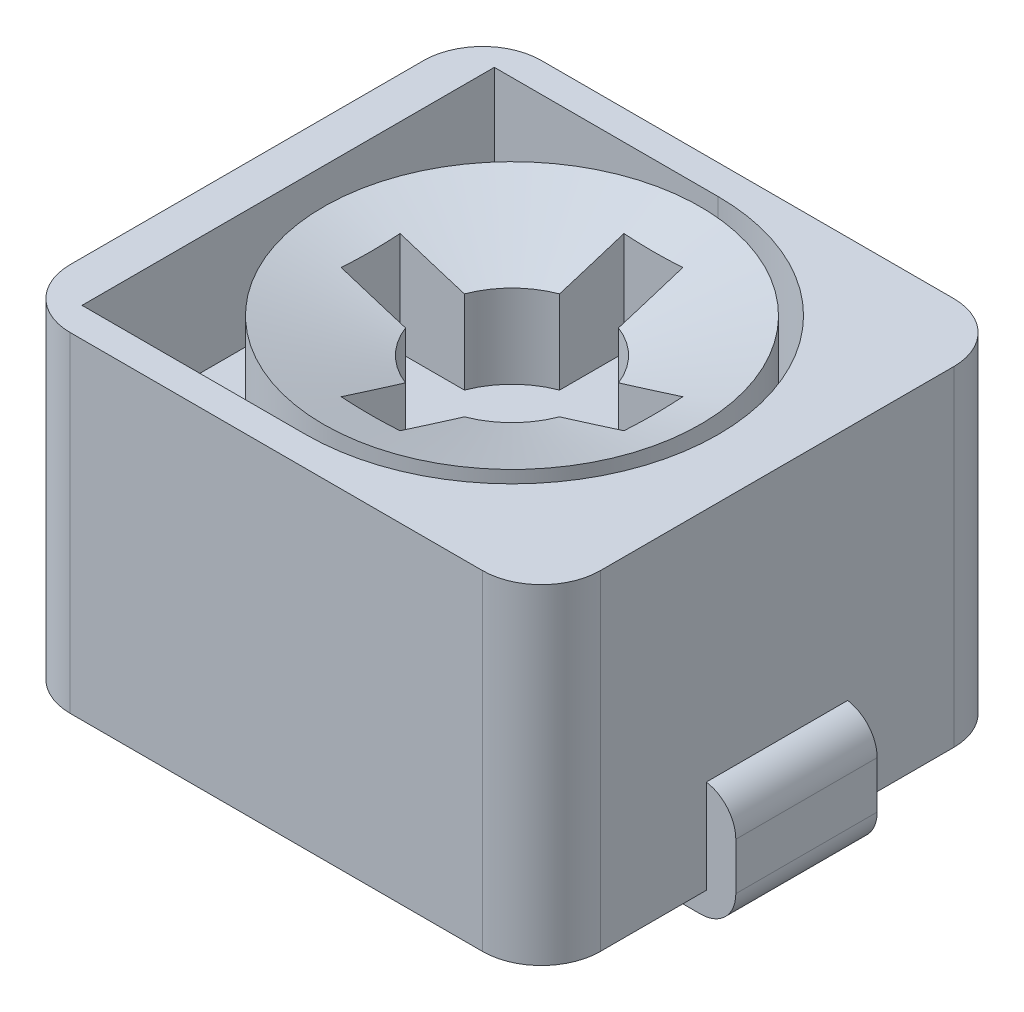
from build123d import *

# Parameters (mm, degrees)
EXTRUDE_1_DEPTH     = 0.6
EXTRUDE_START       = 0.2
EXTRUDE_2_DEPTH     = 2.8
SKETCH_3_R          = 1.6
CUT_EXTRUDE_1_DEPTH = 1
SKETCH_4_R          = 1.6
CUT_EXTRUDE_2_DEPTH = 0.3
CUT_EXTRUDE_2_DRAFT = -72


with BuildPart() as part:
    # Sketch 1 → Extrude 1 (new, symmetric)
    with BuildSketch(Plane.XY):
        with BuildLine():
            Line((1.35, 0), (2.2, 0))
            ThreePointArc((2.2, 0), (2.412132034, 0.087867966), (2.5, 0.3))
            Line((2.5, 0.3), (2.5, 0.7))
            ThreePointArc((2.5, 0.7), (2.412132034, 0.912132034), (2.2, 1))
            Line((2.2, 1), (-2.2, 1))
            ThreePointArc((-2.2, 1), (-2.412132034, 0.912132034), (-2.5, 0.7))
            Line((-2.5, 0.7), (-2.5, 0.3))
            ThreePointArc((-2.5, 0.3), (-2.412132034, 0.087867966), (-2.2, 0))
            Line((-2.2, 0), (-1.35, 0))
            Line((-1.35, 0), (-1.35, 0.9))
            Line((-1.35, 0.9), (1.35, 0.9))
            Line((1.35, 0.9), (1.35, 0))
        make_face()
    extrude(amount=EXTRUDE_1_DEPTH, both=True)

    # Sketch 2 → Extrude 2 (add)
    with BuildSketch(Plane(origin=(0, 0, 0), x_dir=(1, 0, 0), z_dir=(0, 1, 0)).offset(EXTRUDE_START)):
        with BuildLine():
            Line((-1.75, -2), (1.75, -2))
            ThreePointArc((1.75, -2), (2.103553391, -1.853553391), (2.25, -1.5))
            Line((2.25, -1.5), (2.25, 1.5))
            ThreePointArc((2.25, 1.5), (2.103553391, 1.853553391), (1.75, 2))
            Line((1.75, 2), (-1.75, 2))
            ThreePointArc((-1.75, 2), (-2.103553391, 1.853553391), (-2.25, 1.5))
            Line((-2.25, 1.5), (-2.25, -1.5))
            ThreePointArc((-2.25, -1.5), (-2.103553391, -1.853553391), (-1.75, -2))
        make_face()
    extrude(amount=EXTRUDE_2_DEPTH)

    # Sketch 3 → Cut-Extrude 1 (cut)
    # profile 1 of 2: a face of its own
    with BuildSketch(Plane(origin=(0, 3, 0), x_dir=(-1, 0, 0), z_dir=(0, 1, 0))):
        with BuildLine():
            Line((0, -1.75), (1.9, -1.75))
            Line((1.9, -1.75), (1.9, 1.75))
            Line((1.9, 1.75), (0, 1.75))
            ThreePointArc((0, 1.75), (-1.75, 0), (0, -1.75))
        make_face()
        with Locations(Location((0, 0, 0), (0, 0, 90))):
            Circle(SKETCH_3_R, mode=Mode.SUBTRACT)
    # profile 2 of 2: a face of its own
    with BuildSketch(Plane(origin=(0, 3, 0), x_dir=(-1, 0, 0), z_dir=(0, 1, 0))):
        with BuildLine():
            Line((-0.653834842, 0.25), (-1.2, 0.25))
            Line((-1.2, 0.25), (-1.2, -0.25))
            Line((-1.2, -0.25), (-0.653834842, -0.25))
            ThreePointArc((-0.653834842, -0.25), (-0.494974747, -0.494974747), (-0.25, -0.653834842))
            Line((-0.25, -0.653834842), (-0.25, -1.2))
            Line((-0.25, -1.2), (0.25, -1.2))
            Line((0.25, -1.2), (0.25, -0.653834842))
            ThreePointArc((0.25, -0.653834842), (0.494974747, -0.494974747), (0.653834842, -0.25))
            Line((0.653834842, -0.25), (1.2, -0.25))
            Line((1.2, -0.25), (1.2, 0.25))
            Line((1.2, 0.25), (0.653834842, 0.25))
            ThreePointArc((0.653834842, 0.25), (0.494974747, 0.494974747), (0.25, 0.653834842))
            Line((0.25, 0.653834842), (0.25, 1.2))
            Line((0.25, 1.2), (-0.25, 1.2))
            Line((-0.25, 1.2), (-0.25, 0.653834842))
            ThreePointArc((-0.25, 0.653834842), (-0.494974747, 0.494974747), (-0.653834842, 0.25))
        make_face()
    extrude(amount=-CUT_EXTRUDE_1_DEPTH, mode=Mode.SUBTRACT)


with BuildPart() as cut_extrude_2_tool:
    # Sketch 4 → Cut-Extrude 2 (with draft: the straight prism first)
    with BuildSketch(Plane(origin=(0, 3, 0), x_dir=(-1, 0, 0), z_dir=(0, 1, 0))):
        with Locations(Location((0, 0, 0), (0, 0, 90))):
            Circle(SKETCH_4_R)
    extrude(amount=-CUT_EXTRUDE_2_DEPTH)
    # Cut-Extrude 2: the draft: its side faces are tilted about the plane it starts from
    cut_extrude_2_sides = [cut_extrude_2_tool.faces().sort_by_distance(p)[0] for p in [
        (0, 2.85, -1.6),
    ]]
    draft(cut_extrude_2_sides, Plane(origin=(0, 3, 0), x_dir=(-1, 0, 0), z_dir=(0, 1, 0)), CUT_EXTRUDE_2_DRAFT)


with BuildPart() as part_1:
    add(part.part)

    # Cut-Extrude 2: cut by cut_extrude_2_tool
    add(cut_extrude_2_tool.part, mode=Mode.SUBTRACT)


solid = part_1.part
